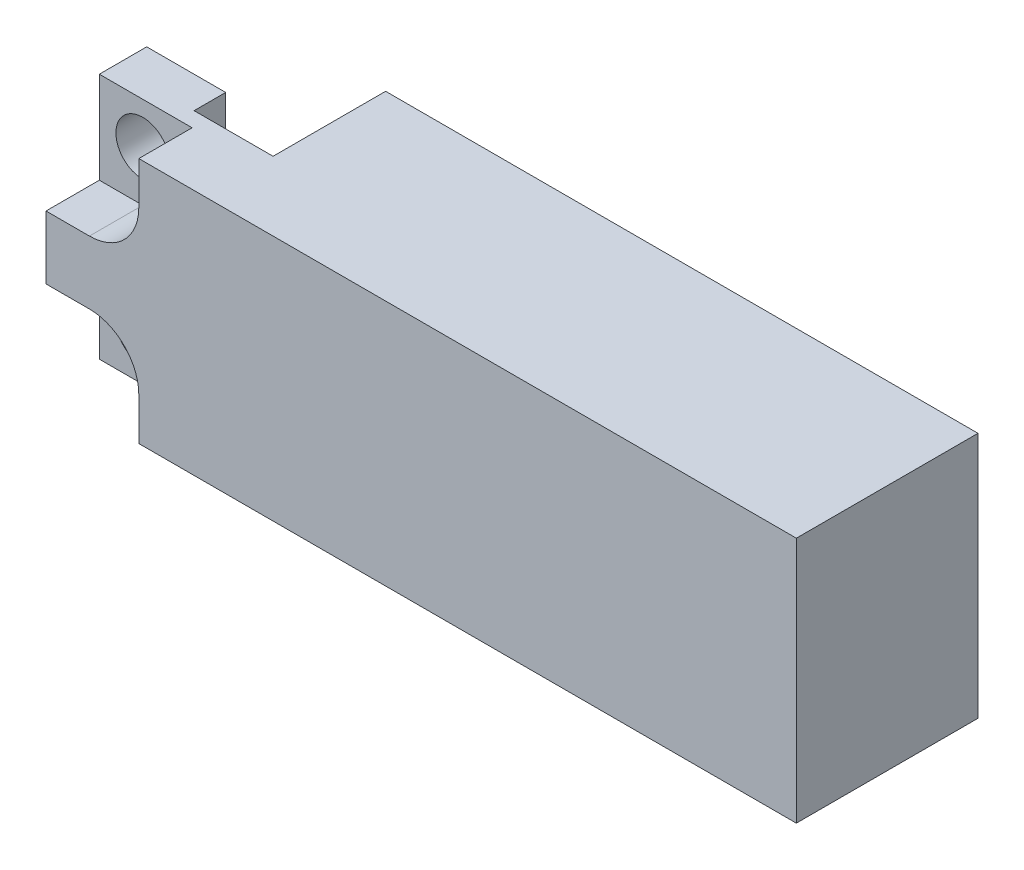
from build123d import *

# Parameters (mm, degrees)
EXTRUDE1_DEPTH                                 = 7.9375
CBORE_FOR_5_SOCKET_HEAD_CAP_SCREW1_D           = 3.4544
CBORE_FOR_5_SOCKET_HEAD_CAP_SCREW1_CBORE_D     = 6.35
CBORE_FOR_5_SOCKET_HEAD_CAP_SCREW1_CBORE_DEPTH = 3.429
CUT_EXTRUDE2_DEPTH                             = 3.429


with BuildPart() as part:
    # Sketch1 → Extrude1 (new, symmetric)
    with BuildSketch(Plane(origin=(0, 0, 0), x_dir=(1, 0, 0), z_dir=(0, 1, 0))):
        Polygon((-10.16, 6.477), (-10.16, 0), (38.1, 0), (38.1, 11.684), (0, 11.684), (0, 4.445), (-5.08, 4.445), (-5.08, 6.477), align=None)
    extrude(amount=EXTRUDE1_DEPTH, both=True)

    # CBORE for _5 Socket Head Cap Screw1 (through all)
    with Locations(Plane(origin=(-7.366, 5.207, 0), x_dir=(1, 0, 0), z_dir=(0, 0, 1))):
        with Locations((0, 0)):
            cbore_for_5_socket_head_cap_screw1 = CounterBoreHole(CBORE_FOR_5_SOCKET_HEAD_CAP_SCREW1_D / 2, CBORE_FOR_5_SOCKET_HEAD_CAP_SCREW1_CBORE_D / 2, CBORE_FOR_5_SOCKET_HEAD_CAP_SCREW1_CBORE_DEPTH)

    # Sketch4 → Cut-Extrude2 (cut)
    with BuildSketch(Plane.XY):
        with BuildLine():
            Line((-4.191, 5.207), (-4.191, 7.9375))
            Line((-4.191, 7.9375), (-10.16, 7.9375))
            Line((-10.16, 7.9375), (-10.16, 2.032))
            Line((-10.16, 2.032), (-7.366, 2.032))
            ThreePointArc((-7.366, 2.032), (-5.12093597, 2.96193597), (-4.191, 5.207))
        make_face()
    cut_extrude2 = extrude(amount=-CUT_EXTRUDE2_DEPTH, mode=Mode.SUBTRACT)

    # Mirror1: CBORE for _5 Socket Head Cap Screw1, Cut-Extrude2 across plane
    add(cbore_for_5_socket_head_cap_screw1.mirror(Plane.ZX), mode=Mode.SUBTRACT)
    add(cut_extrude2.mirror(Plane.ZX), mode=Mode.SUBTRACT)


solid = part.part
